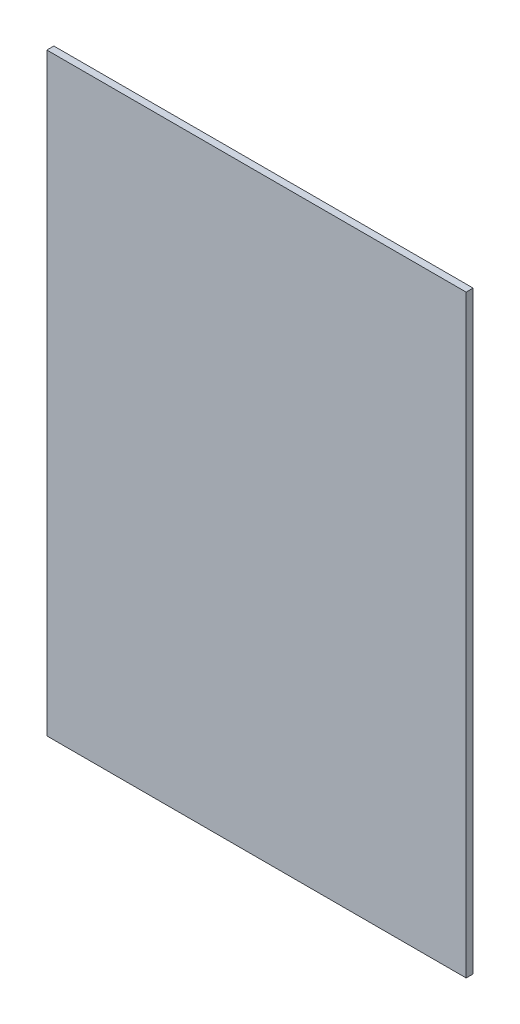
from build123d import *

# Parameters (mm, degrees)
SKETCH1_W           = 152.4
SKETCH1_H           = 215.9
BOSS_EXTRUDE1_DEPTH = 2.54


with BuildPart() as part:
    # Sketch1 → Boss-Extrude1 (new body)
    with BuildSketch(Plane.XY):
        Rectangle(SKETCH1_W, SKETCH1_H)
    extrude(amount=BOSS_EXTRUDE1_DEPTH)


solid = part.part
